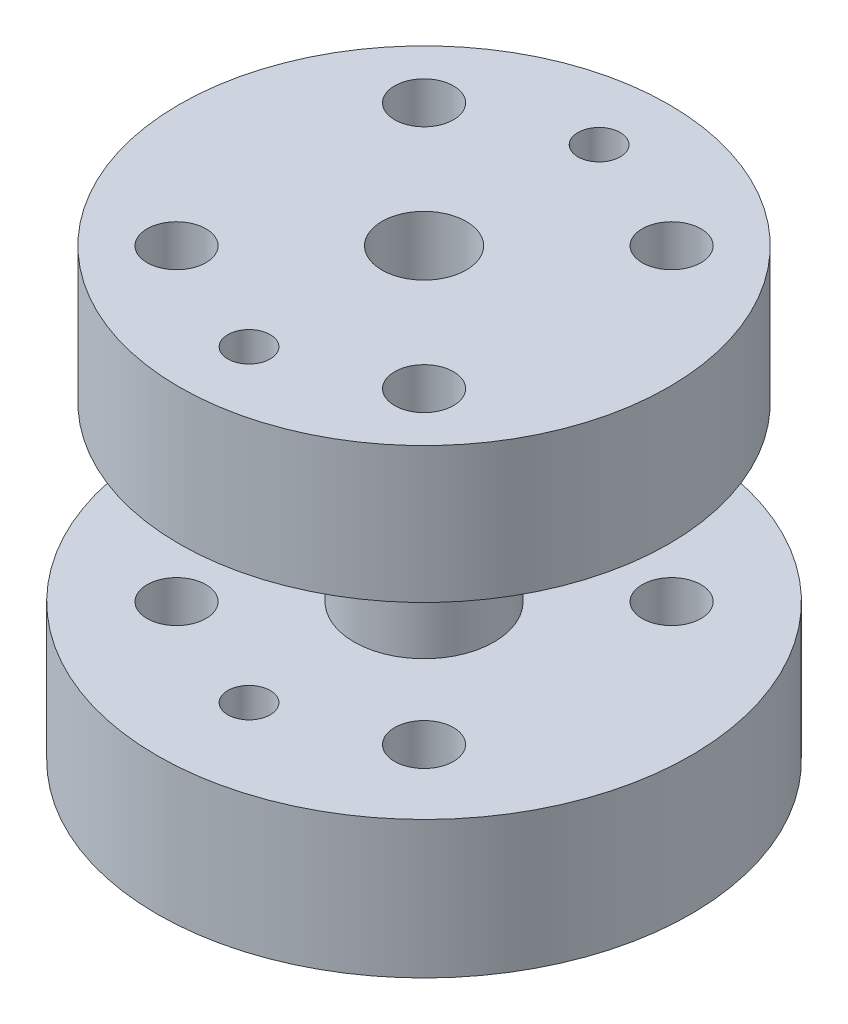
ISO-10303-21;
HEADER;
FILE_DESCRIPTION(('STEP AP214'),'2;1');
FILE_NAME('part.step','',(''),(''),'','','');
FILE_SCHEMA(('AUTOMOTIVE_DESIGN { 1 0 10303 214 1 1 1 1 }'));
ENDSEC;
DATA;
#1=APPLICATION_CONTEXT('core data for automotive mechanical design processes');
#2=APPLICATION_PROTOCOL_DEFINITION('international standard','automotive_design',2000,#1);
#3=PRODUCT_CONTEXT('',#1,'mechanical');
#4=PRODUCT('Part','Part','',(#3));
#5=PRODUCT_RELATED_PRODUCT_CATEGORY('part','',(#4));
#6=PRODUCT_DEFINITION_FORMATION('','',#4);
#7=PRODUCT_DEFINITION_CONTEXT('part definition',#1,'design');
#8=PRODUCT_DEFINITION('design','',#6,#7);
#9=PRODUCT_DEFINITION_SHAPE('','',#8);
#10=(LENGTH_UNIT() NAMED_UNIT(*) SI_UNIT(.MILLI.,.METRE.));
#11=(NAMED_UNIT(*) PLANE_ANGLE_UNIT() SI_UNIT($,.RADIAN.));
#12=(NAMED_UNIT(*) SI_UNIT($,.STERADIAN.) SOLID_ANGLE_UNIT());
#13=UNCERTAINTY_MEASURE_WITH_UNIT(LENGTH_MEASURE(1.E-05),#10,'distance_accuracy_value','');
#14=(GEOMETRIC_REPRESENTATION_CONTEXT(3) GLOBAL_UNCERTAINTY_ASSIGNED_CONTEXT((#13)) GLOBAL_UNIT_ASSIGNED_CONTEXT((#10,
#11,#12)) REPRESENTATION_CONTEXT('',''));
#15=CARTESIAN_POINT('',(0.,0.,0.));
#16=DIRECTION('',(0.,0.,1.));
#17=DIRECTION('',(1.,0.,0.));
#18=AXIS2_PLACEMENT_3D('',#15,#16,#17);
#19=CARTESIAN_POINT('',(0.,0.,0.));
#20=DIRECTION('',(0.,1.,0.));
#21=DIRECTION('',(0.,0.,1.));
#22=AXIS2_PLACEMENT_3D('',#19,#20,#21);
#23=PLANE('',#22);
#24=CARTESIAN_POINT('',(0.,0.,0.));
#25=DIRECTION('',(0.,1.,0.));
#26=DIRECTION('',(0.,0.,1.));
#27=AXIS2_PLACEMENT_3D('',#24,#25,#26);
#28=CIRCLE('',#27,3.01);
#29=CARTESIAN_POINT('',(0.,0.,3.01));
#30=VERTEX_POINT('',#29);
#31=EDGE_CURVE('E130',#30,#30,#28,.T.);
#32=ORIENTED_EDGE('',*,*,#31,.T.);
#33=EDGE_LOOP('',(#32));
#34=FACE_BOUND('',#33,.T.);
#35=CARTESIAN_POINT('',(-8.83529846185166,0.,8.83530000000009));
#36=DIRECTION('',(0.,-1.,0.));
#37=DIRECTION('',(0.,0.,-1.));
#38=AXIS2_PLACEMENT_3D('',#35,#36,#37);
#39=CIRCLE('',#38,2.09999999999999);
#40=CARTESIAN_POINT('',(-8.83529846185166,0.,6.73530000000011));
#41=VERTEX_POINT('',#40);
#42=EDGE_CURVE('E127',#41,#41,#39,.T.);
#43=ORIENTED_EDGE('',*,*,#42,.F.);
#44=EDGE_LOOP('',(#43));
#45=FACE_BOUND('',#44,.T.);
#46=CARTESIAN_POINT('',(-8.8353,0.,-8.83529846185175));
#47=DIRECTION('',(0.,-1.,0.));
#48=DIRECTION('',(0.,0.,-1.));
#49=AXIS2_PLACEMENT_3D('',#46,#47,#48);
#50=CIRCLE('',#49,2.09999999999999);
#51=CARTESIAN_POINT('',(-8.8353,0.,-10.9352984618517));
#52=VERTEX_POINT('',#51);
#53=EDGE_CURVE('E121',#52,#52,#50,.T.);
#54=ORIENTED_EDGE('',*,*,#53,.F.);
#55=EDGE_LOOP('',(#54));
#56=FACE_BOUND('',#55,.T.);
#57=CARTESIAN_POINT('',(8.83529846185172,0.,-8.83530000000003));
#58=DIRECTION('',(0.,-1.,0.));
#59=DIRECTION('',(0.,0.,-1.));
#60=AXIS2_PLACEMENT_3D('',#57,#58,#59);
#61=CIRCLE('',#60,2.09999999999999);
#62=CARTESIAN_POINT('',(8.83529846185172,0.,-10.9353));
#63=VERTEX_POINT('',#62);
#64=EDGE_CURVE('E115',#63,#63,#61,.T.);
#65=ORIENTED_EDGE('',*,*,#64,.F.);
#66=EDGE_LOOP('',(#65));
#67=FACE_BOUND('',#66,.T.);
#68=CARTESIAN_POINT('',(0.,0.,0.));
#69=DIRECTION('',(0.,1.,0.));
#70=DIRECTION('',(0.,0.,1.));
#71=AXIS2_PLACEMENT_3D('',#68,#69,#70);
#72=CIRCLE('',#71,19.05);
#73=CARTESIAN_POINT('',(0.,0.,19.05));
#74=VERTEX_POINT('',#73);
#75=EDGE_CURVE('E38',#74,#74,#72,.T.);
#76=ORIENTED_EDGE('',*,*,#75,.F.);
#77=EDGE_LOOP('',(#76));
#78=FACE_BOUND('',#77,.T.);
#79=CARTESIAN_POINT('',(0.,0.,-12.495));
#80=DIRECTION('',(0.,1.,0.));
#81=DIRECTION('',(0.,0.,1.));
#82=AXIS2_PLACEMENT_3D('',#79,#80,#81);
#83=CIRCLE('',#82,1.51);
#84=CARTESIAN_POINT('',(0.,0.,-10.985));
#85=VERTEX_POINT('',#84);
#86=EDGE_CURVE('E88',#85,#85,#83,.T.);
#87=ORIENTED_EDGE('',*,*,#86,.T.);
#88=EDGE_LOOP('',(#87));
#89=FACE_BOUND('',#88,.T.);
#90=CARTESIAN_POINT('',(0.,0.,12.495));
#91=DIRECTION('',(0.,1.,0.));
#92=DIRECTION('',(0.,0.,-1.));
#93=AXIS2_PLACEMENT_3D('',#90,#91,#92);
#94=CIRCLE('',#93,1.51);
#95=CARTESIAN_POINT('',(0.,0.,10.985));
#96=VERTEX_POINT('',#95);
#97=EDGE_CURVE('E100',#96,#96,#94,.T.);
#98=ORIENTED_EDGE('',*,*,#97,.T.);
#99=EDGE_LOOP('',(#98));
#100=FACE_BOUND('',#99,.T.);
#101=CARTESIAN_POINT('',(8.8353,0.,8.83529846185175));
#102=DIRECTION('',(0.,-1.,0.));
#103=DIRECTION('',(0.,0.,-1.));
#104=AXIS2_PLACEMENT_3D('',#101,#102,#103);
#105=CIRCLE('',#104,2.09999999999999);
#106=CARTESIAN_POINT('',(8.8353,0.,6.73529846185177));
#107=VERTEX_POINT('',#106);
#108=EDGE_CURVE('E109',#107,#107,#105,.T.);
#109=ORIENTED_EDGE('',*,*,#108,.F.);
#110=EDGE_LOOP('',(#109));
#111=FACE_BOUND('',#110,.T.);
#112=ADVANCED_FACE('F34',(#34,#45,#56,#67,#78,#89,#100,#111),#23,.F.);
#113=CARTESIAN_POINT('',(0.,9.8,0.));
#114=DIRECTION('',(0.,1.,0.));
#115=DIRECTION('',(0.,0.,1.));
#116=AXIS2_PLACEMENT_3D('',#113,#114,#115);
#117=PLANE('',#116);
#118=CARTESIAN_POINT('',(-8.83529846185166,9.8,8.83530000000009));
#119=DIRECTION('',(0.,1.,0.));
#120=DIRECTION('',(0.,0.,1.));
#121=AXIS2_PLACEMENT_3D('',#118,#119,#120);
#122=CIRCLE('',#121,2.09999999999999);
#123=CARTESIAN_POINT('',(-8.83529846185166,9.8,10.9353000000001));
#124=VERTEX_POINT('',#123);
#125=EDGE_CURVE('E124',#124,#124,#122,.T.);
#126=ORIENTED_EDGE('',*,*,#125,.F.);
#127=EDGE_LOOP('',(#126));
#128=FACE_BOUND('',#127,.T.);
#129=CARTESIAN_POINT('',(-8.8353,9.8,-8.83529846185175));
#130=DIRECTION('',(0.,1.,0.));
#131=DIRECTION('',(0.,0.,1.));
#132=AXIS2_PLACEMENT_3D('',#129,#130,#131);
#133=CIRCLE('',#132,2.09999999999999);
#134=CARTESIAN_POINT('',(-8.8353,9.8,-6.73529846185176));
#135=VERTEX_POINT('',#134);
#136=EDGE_CURVE('E118',#135,#135,#133,.T.);
#137=ORIENTED_EDGE('',*,*,#136,.F.);
#138=EDGE_LOOP('',(#137));
#139=FACE_BOUND('',#138,.T.);
#140=CARTESIAN_POINT('',(8.83529846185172,9.8,-8.83530000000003));
#141=DIRECTION('',(0.,1.,0.));
#142=DIRECTION('',(0.,0.,1.));
#143=AXIS2_PLACEMENT_3D('',#140,#141,#142);
#144=CIRCLE('',#143,2.09999999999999);
#145=CARTESIAN_POINT('',(8.83529846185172,9.8,-6.73530000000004));
#146=VERTEX_POINT('',#145);
#147=EDGE_CURVE('E112',#146,#146,#144,.T.);
#148=ORIENTED_EDGE('',*,*,#147,.F.);
#149=EDGE_LOOP('',(#148));
#150=FACE_BOUND('',#149,.T.);
#151=CARTESIAN_POINT('',(8.8353,9.8,8.83529846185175));
#152=DIRECTION('',(0.,1.,0.));
#153=DIRECTION('',(0.,0.,1.));
#154=AXIS2_PLACEMENT_3D('',#151,#152,#153);
#155=CIRCLE('',#154,2.09999999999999);
#156=CARTESIAN_POINT('',(8.8353,9.8,10.9352984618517));
#157=VERTEX_POINT('',#156);
#158=EDGE_CURVE('E104',#157,#157,#155,.T.);
#159=ORIENTED_EDGE('',*,*,#158,.F.);
#160=EDGE_LOOP('',(#159));
#161=FACE_BOUND('',#160,.T.);
#162=CARTESIAN_POINT('',(0.,9.8,12.495));
#163=DIRECTION('',(0.,1.,0.));
#164=DIRECTION('',(0.,0.,1.));
#165=AXIS2_PLACEMENT_3D('',#162,#163,#164);
#166=CIRCLE('',#165,1.51);
#167=CARTESIAN_POINT('',(0.,9.8,14.005));
#168=VERTEX_POINT('',#167);
#169=EDGE_CURVE('E92',#168,#168,#166,.T.);
#170=ORIENTED_EDGE('',*,*,#169,.F.);
#171=EDGE_LOOP('',(#170));
#172=FACE_BOUND('',#171,.T.);
#173=CARTESIAN_POINT('',(0.,9.8,-12.495));
#174=DIRECTION('',(0.,1.,0.));
#175=DIRECTION('',(0.,0.,1.));
#176=AXIS2_PLACEMENT_3D('',#173,#174,#175);
#177=CIRCLE('',#176,1.51);
#178=CARTESIAN_POINT('',(0.,9.8,-10.985));
#179=VERTEX_POINT('',#178);
#180=EDGE_CURVE('E82',#179,#179,#177,.T.);
#181=ORIENTED_EDGE('',*,*,#180,.F.);
#182=EDGE_LOOP('',(#181));
#183=FACE_BOUND('',#182,.T.);
#184=CARTESIAN_POINT('',(0.,9.8,0.));
#185=DIRECTION('',(0.,1.,0.));
#186=DIRECTION('',(0.,0.,1.));
#187=AXIS2_PLACEMENT_3D('',#184,#185,#186);
#188=CIRCLE('',#187,19.05);
#189=CARTESIAN_POINT('',(0.,9.8,19.05));
#190=VERTEX_POINT('',#189);
#191=EDGE_CURVE('E10',#190,#190,#188,.T.);
#192=ORIENTED_EDGE('',*,*,#191,.T.);
#193=EDGE_LOOP('',(#192));
#194=FACE_BOUND('',#193,.T.);
#195=CARTESIAN_POINT('',(0.,9.8,0.));
#196=DIRECTION('',(0.,1.,0.));
#197=DIRECTION('',(0.,0.,1.));
#198=AXIS2_PLACEMENT_3D('',#195,#196,#197);
#199=CIRCLE('',#198,5.);
#200=CARTESIAN_POINT('',(0.,9.8,5.));
#201=VERTEX_POINT('',#200);
#202=EDGE_CURVE('E47',#201,#201,#199,.T.);
#203=ORIENTED_EDGE('',*,*,#202,.F.);
#204=EDGE_LOOP('',(#203));
#205=FACE_BOUND('',#204,.T.);
#206=ADVANCED_FACE('F184',(#128,#139,#150,#161,#172,#183,#194,#205),#117,.T.);
#207=CARTESIAN_POINT('',(0.,9.8,0.));
#208=DIRECTION('',(0.,-1.,0.));
#209=DIRECTION('',(0.,0.,-1.));
#210=AXIS2_PLACEMENT_3D('',#207,#208,#209);
#211=CYLINDRICAL_SURFACE('',#210,19.05);
#212=ORIENTED_EDGE('',*,*,#191,.F.);
#213=EDGE_LOOP('',(#212));
#214=FACE_BOUND('',#213,.T.);
#215=ORIENTED_EDGE('',*,*,#75,.T.);
#216=EDGE_LOOP('',(#215));
#217=FACE_BOUND('',#216,.T.);
#218=ADVANCED_FACE('F36',(#214,#217),#211,.T.);
#219=CARTESIAN_POINT('',(0.,22.1,0.));
#220=DIRECTION('',(0.,-1.,0.));
#221=DIRECTION('',(0.,0.,-1.));
#222=AXIS2_PLACEMENT_3D('',#219,#220,#221);
#223=CYLINDRICAL_SURFACE('',#222,5.);
#224=CARTESIAN_POINT('',(0.,22.1,0.));
#225=DIRECTION('',(0.,1.,0.));
#226=DIRECTION('',(0.,0.,1.));
#227=AXIS2_PLACEMENT_3D('',#224,#225,#226);
#228=CIRCLE('',#227,5.);
#229=CARTESIAN_POINT('',(0.,22.1,5.));
#230=VERTEX_POINT('',#229);
#231=EDGE_CURVE('E45',#230,#230,#228,.T.);
#232=ORIENTED_EDGE('',*,*,#231,.F.);
#233=EDGE_LOOP('',(#232));
#234=FACE_BOUND('',#233,.T.);
#235=ORIENTED_EDGE('',*,*,#202,.T.);
#236=EDGE_LOOP('',(#235));
#237=FACE_BOUND('',#236,.T.);
#238=ADVANCED_FACE('F174',(#234,#237),#223,.T.);
#239=CARTESIAN_POINT('',(0.,22.1,0.));
#240=DIRECTION('',(0.,1.,0.));
#241=DIRECTION('',(0.,0.,1.));
#242=AXIS2_PLACEMENT_3D('',#239,#240,#241);
#243=PLANE('',#242);
#244=CARTESIAN_POINT('',(0.,22.1,12.495));
#245=DIRECTION('',(0.,1.,0.));
#246=DIRECTION('',(0.,0.,1.));
#247=AXIS2_PLACEMENT_3D('',#244,#245,#246);
#248=CIRCLE('',#247,1.51);
#249=CARTESIAN_POINT('',(0.,22.1,14.005));
#250=VERTEX_POINT('',#249);
#251=EDGE_CURVE('E97',#250,#250,#248,.T.);
#252=ORIENTED_EDGE('',*,*,#251,.T.);
#253=EDGE_LOOP('',(#252));
#254=FACE_BOUND('',#253,.T.);
#255=CARTESIAN_POINT('',(0.,22.1,-12.495));
#256=DIRECTION('',(0.,1.,0.));
#257=DIRECTION('',(0.,0.,1.));
#258=AXIS2_PLACEMENT_3D('',#255,#256,#257);
#259=CIRCLE('',#258,1.51);
#260=CARTESIAN_POINT('',(0.,22.1,-10.985));
#261=VERTEX_POINT('',#260);
#262=EDGE_CURVE('E85',#261,#261,#259,.T.);
#263=ORIENTED_EDGE('',*,*,#262,.T.);
#264=EDGE_LOOP('',(#263));
#265=FACE_BOUND('',#264,.T.);
#266=CARTESIAN_POINT('',(8.83529846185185,22.1,8.83529999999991));
#267=DIRECTION('',(0.,1.,0.));
#268=DIRECTION('',(0.,0.,1.));
#269=AXIS2_PLACEMENT_3D('',#266,#267,#268);
#270=CIRCLE('',#269,2.09999999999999);
#271=CARTESIAN_POINT('',(8.83529846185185,22.1,10.9352999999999));
#272=VERTEX_POINT('',#271);
#273=EDGE_CURVE('E76',#272,#272,#270,.T.);
#274=ORIENTED_EDGE('',*,*,#273,.T.);
#275=EDGE_LOOP('',(#274));
#276=FACE_BOUND('',#275,.T.);
#277=CARTESIAN_POINT('',(-8.8353,22.1,8.83529846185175));
#278=DIRECTION('',(0.,1.,0.));
#279=DIRECTION('',(0.,0.,1.));
#280=AXIS2_PLACEMENT_3D('',#277,#278,#279);
#281=CIRCLE('',#280,2.09999999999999);
#282=CARTESIAN_POINT('',(-8.8353,22.1,10.9352984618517));
#283=VERTEX_POINT('',#282);
#284=EDGE_CURVE('E70',#283,#283,#281,.T.);
#285=ORIENTED_EDGE('',*,*,#284,.T.);
#286=EDGE_LOOP('',(#285));
#287=FACE_BOUND('',#286,.T.);
#288=CARTESIAN_POINT('',(-8.83529846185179,22.1,-8.83529999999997));
#289=DIRECTION('',(0.,1.,0.));
#290=DIRECTION('',(0.,0.,1.));
#291=AXIS2_PLACEMENT_3D('',#288,#289,#290);
#292=CIRCLE('',#291,2.09999999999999);
#293=CARTESIAN_POINT('',(-8.83529846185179,22.1,-6.73529999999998));
#294=VERTEX_POINT('',#293);
#295=EDGE_CURVE('E64',#294,#294,#292,.T.);
#296=ORIENTED_EDGE('',*,*,#295,.T.);
#297=EDGE_LOOP('',(#296));
#298=FACE_BOUND('',#297,.T.);
#299=CARTESIAN_POINT('',(8.8353,22.1,-8.83529846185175));
#300=DIRECTION('',(0.,1.,0.));
#301=DIRECTION('',(0.,0.,1.));
#302=AXIS2_PLACEMENT_3D('',#299,#300,#301);
#303=CIRCLE('',#302,2.09999999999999);
#304=CARTESIAN_POINT('',(8.8353,22.1,-6.73529846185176));
#305=VERTEX_POINT('',#304);
#306=EDGE_CURVE('E56',#305,#305,#303,.T.);
#307=ORIENTED_EDGE('',*,*,#306,.T.);
#308=EDGE_LOOP('',(#307));
#309=FACE_BOUND('',#308,.T.);
#310=CARTESIAN_POINT('',(0.,22.1,0.));
#311=DIRECTION('',(0.,1.,0.));
#312=DIRECTION('',(0.,0.,1.));
#313=AXIS2_PLACEMENT_3D('',#310,#311,#312);
#314=CIRCLE('',#313,17.475);
#315=CARTESIAN_POINT('',(0.,22.1,17.475));
#316=VERTEX_POINT('',#315);
#317=EDGE_CURVE('E53',#316,#316,#314,.T.);
#318=ORIENTED_EDGE('',*,*,#317,.F.);
#319=EDGE_LOOP('',(#318));
#320=FACE_BOUND('',#319,.T.);
#321=ORIENTED_EDGE('',*,*,#231,.T.);
#322=EDGE_LOOP('',(#321));
#323=FACE_BOUND('',#322,.T.);
#324=ADVANCED_FACE('F168',(#254,#265,#276,#287,#298,#309,#320,#323),#243,.F.);
#325=CARTESIAN_POINT('',(0.,31.8,0.));
#326=DIRECTION('',(0.,-1.,0.));
#327=DIRECTION('',(0.,0.,-1.));
#328=AXIS2_PLACEMENT_3D('',#325,#326,#327);
#329=CYLINDRICAL_SURFACE('',#328,17.475);
#330=CARTESIAN_POINT('',(0.,31.8,0.));
#331=DIRECTION('',(0.,1.,0.));
#332=DIRECTION('',(0.,0.,1.));
#333=AXIS2_PLACEMENT_3D('',#330,#331,#332);
#334=CIRCLE('',#333,17.475);
#335=CARTESIAN_POINT('',(0.,31.8,17.475));
#336=VERTEX_POINT('',#335);
#337=EDGE_CURVE('E50',#336,#336,#334,.T.);
#338=ORIENTED_EDGE('',*,*,#337,.F.);
#339=EDGE_LOOP('',(#338));
#340=FACE_BOUND('',#339,.T.);
#341=ORIENTED_EDGE('',*,*,#317,.T.);
#342=EDGE_LOOP('',(#341));
#343=FACE_BOUND('',#342,.T.);
#344=ADVANCED_FACE('F150',(#340,#343),#329,.T.);
#345=CARTESIAN_POINT('',(0.,31.8,0.));
#346=DIRECTION('',(0.,1.,0.));
#347=DIRECTION('',(0.,0.,1.));
#348=AXIS2_PLACEMENT_3D('',#345,#346,#347);
#349=PLANE('',#348);
#350=CARTESIAN_POINT('',(0.,31.8,0.));
#351=DIRECTION('',(0.,1.,0.));
#352=DIRECTION('',(0.,0.,1.));
#353=AXIS2_PLACEMENT_3D('',#350,#351,#352);
#354=CIRCLE('',#353,3.01);
#355=CARTESIAN_POINT('',(0.,31.8,3.01));
#356=VERTEX_POINT('',#355);
#357=EDGE_CURVE('E131',#356,#356,#354,.T.);
#358=ORIENTED_EDGE('',*,*,#357,.F.);
#359=EDGE_LOOP('',(#358));
#360=FACE_BOUND('',#359,.T.);
#361=CARTESIAN_POINT('',(0.,31.8,12.495));
#362=DIRECTION('',(0.,1.,0.));
#363=DIRECTION('',(0.,0.,-1.));
#364=AXIS2_PLACEMENT_3D('',#361,#362,#363);
#365=CIRCLE('',#364,1.51);
#366=CARTESIAN_POINT('',(0.,31.8,10.985));
#367=VERTEX_POINT('',#366);
#368=EDGE_CURVE('E101',#367,#367,#365,.T.);
#369=ORIENTED_EDGE('',*,*,#368,.F.);
#370=EDGE_LOOP('',(#369));
#371=FACE_BOUND('',#370,.T.);
#372=CARTESIAN_POINT('',(0.,31.8,-12.495));
#373=DIRECTION('',(0.,1.,0.));
#374=DIRECTION('',(0.,0.,1.));
#375=AXIS2_PLACEMENT_3D('',#372,#373,#374);
#376=CIRCLE('',#375,1.51);
#377=CARTESIAN_POINT('',(0.,31.8,-10.985));
#378=VERTEX_POINT('',#377);
#379=EDGE_CURVE('E89',#378,#378,#376,.T.);
#380=ORIENTED_EDGE('',*,*,#379,.F.);
#381=EDGE_LOOP('',(#380));
#382=FACE_BOUND('',#381,.T.);
#383=CARTESIAN_POINT('',(8.83529846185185,31.8,8.83529999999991));
#384=DIRECTION('',(0.,1.,0.));
#385=DIRECTION('',(0.,0.,1.));
#386=AXIS2_PLACEMENT_3D('',#383,#384,#385);
#387=CIRCLE('',#386,2.09999999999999);
#388=CARTESIAN_POINT('',(8.83529846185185,31.8,10.9352999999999));
#389=VERTEX_POINT('',#388);
#390=EDGE_CURVE('E79',#389,#389,#387,.T.);
#391=ORIENTED_EDGE('',*,*,#390,.F.);
#392=EDGE_LOOP('',(#391));
#393=FACE_BOUND('',#392,.T.);
#394=CARTESIAN_POINT('',(-8.8353,31.8,8.83529846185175));
#395=DIRECTION('',(0.,1.,0.));
#396=DIRECTION('',(0.,0.,1.));
#397=AXIS2_PLACEMENT_3D('',#394,#395,#396);
#398=CIRCLE('',#397,2.09999999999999);
#399=CARTESIAN_POINT('',(-8.8353,31.8,10.9352984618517));
#400=VERTEX_POINT('',#399);
#401=EDGE_CURVE('E73',#400,#400,#398,.T.);
#402=ORIENTED_EDGE('',*,*,#401,.F.);
#403=EDGE_LOOP('',(#402));
#404=FACE_BOUND('',#403,.T.);
#405=CARTESIAN_POINT('',(-8.83529846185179,31.8,-8.83529999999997));
#406=DIRECTION('',(0.,1.,0.));
#407=DIRECTION('',(0.,0.,1.));
#408=AXIS2_PLACEMENT_3D('',#405,#406,#407);
#409=CIRCLE('',#408,2.09999999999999);
#410=CARTESIAN_POINT('',(-8.83529846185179,31.8,-6.73529999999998));
#411=VERTEX_POINT('',#410);
#412=EDGE_CURVE('E67',#411,#411,#409,.T.);
#413=ORIENTED_EDGE('',*,*,#412,.F.);
#414=EDGE_LOOP('',(#413));
#415=FACE_BOUND('',#414,.T.);
#416=CARTESIAN_POINT('',(8.8353,31.8,-8.83529846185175));
#417=DIRECTION('',(0.,1.,0.));
#418=DIRECTION('',(0.,0.,1.));
#419=AXIS2_PLACEMENT_3D('',#416,#417,#418);
#420=CIRCLE('',#419,2.09999999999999);
#421=CARTESIAN_POINT('',(8.8353,31.8,-6.73529846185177));
#422=VERTEX_POINT('',#421);
#423=EDGE_CURVE('E61',#422,#422,#420,.T.);
#424=ORIENTED_EDGE('',*,*,#423,.F.);
#425=EDGE_LOOP('',(#424));
#426=FACE_BOUND('',#425,.T.);
#427=ORIENTED_EDGE('',*,*,#337,.T.);
#428=EDGE_LOOP('',(#427));
#429=FACE_BOUND('',#428,.T.);
#430=ADVANCED_FACE('F146',(#360,#371,#382,#393,#404,#415,#426,#429),#349,.T.);
#431=CARTESIAN_POINT('',(8.8353,31.8,-8.83529846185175));
#432=DIRECTION('',(0.,1.,0.));
#433=DIRECTION('',(0.,0.,1.));
#434=AXIS2_PLACEMENT_3D('',#431,#432,#433);
#435=CYLINDRICAL_SURFACE('',#434,2.09999999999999);
#436=ORIENTED_EDGE('',*,*,#306,.F.);
#437=EDGE_LOOP('',(#436));
#438=FACE_BOUND('',#437,.T.);
#439=ORIENTED_EDGE('',*,*,#423,.T.);
#440=EDGE_LOOP('',(#439));
#441=FACE_BOUND('',#440,.T.);
#442=ADVANCED_FACE('F149',(#438,#441),#435,.F.);
#443=CARTESIAN_POINT('',(-8.83529846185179,31.8,-8.83529999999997));
#444=DIRECTION('',(0.,1.,0.));
#445=DIRECTION('',(0.,0.,1.));
#446=AXIS2_PLACEMENT_3D('',#443,#444,#445);
#447=CYLINDRICAL_SURFACE('',#446,2.09999999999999);
#448=ORIENTED_EDGE('',*,*,#295,.F.);
#449=EDGE_LOOP('',(#448));
#450=FACE_BOUND('',#449,.T.);
#451=ORIENTED_EDGE('',*,*,#412,.T.);
#452=EDGE_LOOP('',(#451));
#453=FACE_BOUND('',#452,.T.);
#454=ADVANCED_FACE('F198',(#450,#453),#447,.F.);
#455=CARTESIAN_POINT('',(-8.8353,31.8,8.83529846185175));
#456=DIRECTION('',(0.,1.,0.));
#457=DIRECTION('',(0.,0.,1.));
#458=AXIS2_PLACEMENT_3D('',#455,#456,#457);
#459=CYLINDRICAL_SURFACE('',#458,2.09999999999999);
#460=ORIENTED_EDGE('',*,*,#284,.F.);
#461=EDGE_LOOP('',(#460));
#462=FACE_BOUND('',#461,.T.);
#463=ORIENTED_EDGE('',*,*,#401,.T.);
#464=EDGE_LOOP('',(#463));
#465=FACE_BOUND('',#464,.T.);
#466=ADVANCED_FACE('F202',(#462,#465),#459,.F.);
#467=CARTESIAN_POINT('',(8.83529846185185,31.8,8.83529999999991));
#468=DIRECTION('',(0.,1.,0.));
#469=DIRECTION('',(0.,0.,1.));
#470=AXIS2_PLACEMENT_3D('',#467,#468,#469);
#471=CYLINDRICAL_SURFACE('',#470,2.09999999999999);
#472=ORIENTED_EDGE('',*,*,#273,.F.);
#473=EDGE_LOOP('',(#472));
#474=FACE_BOUND('',#473,.T.);
#475=ORIENTED_EDGE('',*,*,#390,.T.);
#476=EDGE_LOOP('',(#475));
#477=FACE_BOUND('',#476,.T.);
#478=ADVANCED_FACE('F206',(#474,#477),#471,.F.);
#479=CARTESIAN_POINT('',(0.,0.,-12.495));
#480=DIRECTION('',(0.,1.,0.));
#481=DIRECTION('',(0.,0.,1.));
#482=AXIS2_PLACEMENT_3D('',#479,#480,#481);
#483=CYLINDRICAL_SURFACE('',#482,1.51);
#484=ORIENTED_EDGE('',*,*,#379,.T.);
#485=EDGE_LOOP('',(#484));
#486=FACE_BOUND('',#485,.T.);
#487=ORIENTED_EDGE('',*,*,#262,.F.);
#488=EDGE_LOOP('',(#487));
#489=FACE_BOUND('',#488,.T.);
#490=ADVANCED_FACE('F210',(#486,#489),#483,.F.);
#491=ORIENTED_EDGE('',*,*,#180,.T.);
#492=EDGE_LOOP('',(#491));
#493=FACE_BOUND('',#492,.T.);
#494=ORIENTED_EDGE('',*,*,#86,.F.);
#495=EDGE_LOOP('',(#494));
#496=FACE_BOUND('',#495,.T.);
#497=ADVANCED_FACE('F212',(#493,#496),#483,.F.);
#498=CARTESIAN_POINT('',(0.,0.,12.495));
#499=DIRECTION('',(0.,1.,0.));
#500=DIRECTION('',(0.,0.,1.));
#501=AXIS2_PLACEMENT_3D('',#498,#499,#500);
#502=CYLINDRICAL_SURFACE('',#501,1.51);
#503=ORIENTED_EDGE('',*,*,#368,.T.);
#504=EDGE_LOOP('',(#503));
#505=FACE_BOUND('',#504,.T.);
#506=ORIENTED_EDGE('',*,*,#251,.F.);
#507=EDGE_LOOP('',(#506));
#508=FACE_BOUND('',#507,.T.);
#509=ADVANCED_FACE('F215',(#505,#508),#502,.F.);
#510=ORIENTED_EDGE('',*,*,#169,.T.);
#511=EDGE_LOOP('',(#510));
#512=FACE_BOUND('',#511,.T.);
#513=ORIENTED_EDGE('',*,*,#97,.F.);
#514=EDGE_LOOP('',(#513));
#515=FACE_BOUND('',#514,.T.);
#516=ADVANCED_FACE('F217',(#512,#515),#502,.F.);
#517=CARTESIAN_POINT('',(8.8353,0.,8.83529846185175));
#518=DIRECTION('',(0.,-1.,0.));
#519=DIRECTION('',(0.,0.,-1.));
#520=AXIS2_PLACEMENT_3D('',#517,#518,#519);
#521=CYLINDRICAL_SURFACE('',#520,2.09999999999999);
#522=ORIENTED_EDGE('',*,*,#108,.T.);
#523=EDGE_LOOP('',(#522));
#524=FACE_BOUND('',#523,.T.);
#525=ORIENTED_EDGE('',*,*,#158,.T.);
#526=EDGE_LOOP('',(#525));
#527=FACE_BOUND('',#526,.T.);
#528=ADVANCED_FACE('F220',(#524,#527),#521,.F.);
#529=CARTESIAN_POINT('',(8.83529846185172,0.,-8.83530000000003));
#530=DIRECTION('',(0.,-1.,0.));
#531=DIRECTION('',(0.,0.,-1.));
#532=AXIS2_PLACEMENT_3D('',#529,#530,#531);
#533=CYLINDRICAL_SURFACE('',#532,2.09999999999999);
#534=ORIENTED_EDGE('',*,*,#64,.T.);
#535=EDGE_LOOP('',(#534));
#536=FACE_BOUND('',#535,.T.);
#537=ORIENTED_EDGE('',*,*,#147,.T.);
#538=EDGE_LOOP('',(#537));
#539=FACE_BOUND('',#538,.T.);
#540=ADVANCED_FACE('F224',(#536,#539),#533,.F.);
#541=CARTESIAN_POINT('',(-8.8353,0.,-8.83529846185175));
#542=DIRECTION('',(0.,-1.,0.));
#543=DIRECTION('',(0.,0.,-1.));
#544=AXIS2_PLACEMENT_3D('',#541,#542,#543);
#545=CYLINDRICAL_SURFACE('',#544,2.09999999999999);
#546=ORIENTED_EDGE('',*,*,#53,.T.);
#547=EDGE_LOOP('',(#546));
#548=FACE_BOUND('',#547,.T.);
#549=ORIENTED_EDGE('',*,*,#136,.T.);
#550=EDGE_LOOP('',(#549));
#551=FACE_BOUND('',#550,.T.);
#552=ADVANCED_FACE('F228',(#548,#551),#545,.F.);
#553=CARTESIAN_POINT('',(-8.83529846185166,0.,8.83530000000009));
#554=DIRECTION('',(0.,-1.,0.));
#555=DIRECTION('',(0.,0.,-1.));
#556=AXIS2_PLACEMENT_3D('',#553,#554,#555);
#557=CYLINDRICAL_SURFACE('',#556,2.09999999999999);
#558=ORIENTED_EDGE('',*,*,#42,.T.);
#559=EDGE_LOOP('',(#558));
#560=FACE_BOUND('',#559,.T.);
#561=ORIENTED_EDGE('',*,*,#125,.T.);
#562=EDGE_LOOP('',(#561));
#563=FACE_BOUND('',#562,.T.);
#564=ADVANCED_FACE('F142',(#560,#563),#557,.F.);
#565=CARTESIAN_POINT('',(0.,0.,0.));
#566=DIRECTION('',(0.,1.,0.));
#567=DIRECTION('',(0.,0.,1.));
#568=AXIS2_PLACEMENT_3D('',#565,#566,#567);
#569=CYLINDRICAL_SURFACE('',#568,3.01);
#570=ORIENTED_EDGE('',*,*,#31,.F.);
#571=EDGE_LOOP('',(#570));
#572=FACE_BOUND('',#571,.T.);
#573=ORIENTED_EDGE('',*,*,#357,.T.);
#574=EDGE_LOOP('',(#573));
#575=FACE_BOUND('',#574,.T.);
#576=ADVANCED_FACE('F139',(#572,#575),#569,.F.);
#577=CLOSED_SHELL('',(#112,#206,#218,#238,#324,#344,#430,#442,#454,#466,#478,#490,#497,#509,
#516,#528,#540,#552,#564,#576));
#578=MANIFOLD_SOLID_BREP('B2',#577);
#579=ADVANCED_BREP_SHAPE_REPRESENTATION('',(#18,#578),#14);
#580=SHAPE_DEFINITION_REPRESENTATION(#9,#579);
ENDSEC;
END-ISO-10303-21;
